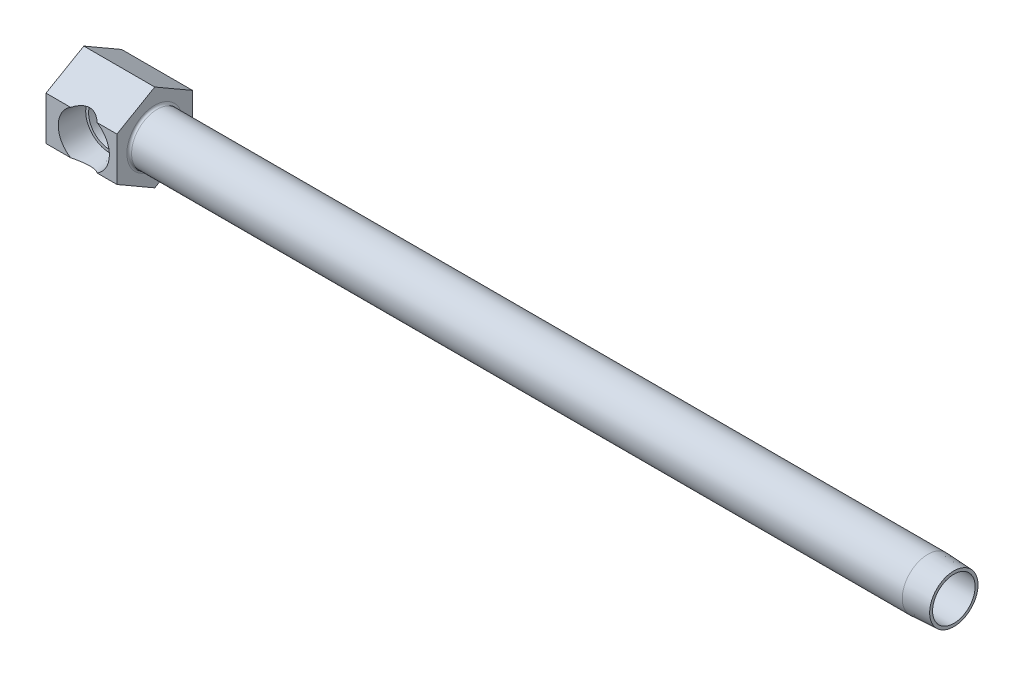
ISO-10303-21;
HEADER;
FILE_DESCRIPTION(('STEP AP214'),'2;1');
FILE_NAME('part.step','',(''),(''),'','','');
FILE_SCHEMA(('AUTOMOTIVE_DESIGN { 1 0 10303 214 1 1 1 1 }'));
ENDSEC;
DATA;
#1=APPLICATION_CONTEXT('core data for automotive mechanical design processes');
#2=APPLICATION_PROTOCOL_DEFINITION('international standard','automotive_design',2000,#1);
#3=PRODUCT_CONTEXT('',#1,'mechanical');
#4=PRODUCT('Part','Part','',(#3));
#5=PRODUCT_RELATED_PRODUCT_CATEGORY('part','',(#4));
#6=PRODUCT_DEFINITION_FORMATION('','',#4);
#7=PRODUCT_DEFINITION_CONTEXT('part definition',#1,'design');
#8=PRODUCT_DEFINITION('design','',#6,#7);
#9=PRODUCT_DEFINITION_SHAPE('','',#8);
#10=(LENGTH_UNIT() NAMED_UNIT(*) SI_UNIT(.MILLI.,.METRE.));
#11=(NAMED_UNIT(*) PLANE_ANGLE_UNIT() SI_UNIT($,.RADIAN.));
#12=(NAMED_UNIT(*) SI_UNIT($,.STERADIAN.) SOLID_ANGLE_UNIT());
#13=UNCERTAINTY_MEASURE_WITH_UNIT(LENGTH_MEASURE(1.E-05),#10,'distance_accuracy_value','');
#14=(GEOMETRIC_REPRESENTATION_CONTEXT(3) GLOBAL_UNCERTAINTY_ASSIGNED_CONTEXT((#13)) GLOBAL_UNIT_ASSIGNED_CONTEXT((#10,
#11,#12)) REPRESENTATION_CONTEXT('',''));
#15=CARTESIAN_POINT('',(0.,0.,0.));
#16=DIRECTION('',(0.,0.,1.));
#17=DIRECTION('',(1.,0.,0.));
#18=AXIS2_PLACEMENT_3D('',#15,#16,#17);
#19=CARTESIAN_POINT('',(63.5,0.,12.7));
#20=DIRECTION('',(-1.,0.,0.));
#21=DIRECTION('',(0.,-1.,0.));
#22=AXIS2_PLACEMENT_3D('',#19,#20,#21);
#23=CYLINDRICAL_SURFACE('',#22,8.5725);
#24=CARTESIAN_POINT('',(24.5999,0.,12.7));
#25=DIRECTION('',(-1.,0.,0.));
#26=DIRECTION('',(0.,-1.,0.));
#27=AXIS2_PLACEMENT_3D('',#24,#25,#26);
#28=CIRCLE('',#27,8.5725);
#29=CARTESIAN_POINT('',(24.5999,-8.57249999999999,12.7));
#30=VERTEX_POINT('',#29);
#31=EDGE_CURVE('E22',#30,#30,#28,.F.);
#32=ORIENTED_EDGE('',*,*,#31,.T.);
#33=EDGE_LOOP('',(#32));
#34=FACE_BOUND('',#33,.T.);
#35=CARTESIAN_POINT('',(283.3624,0.,12.7));
#36=DIRECTION('',(1.,0.,0.));
#37=DIRECTION('',(0.,0.,-1.));
#38=AXIS2_PLACEMENT_3D('',#35,#36,#37);
#39=CIRCLE('',#38,8.5725);
#40=CARTESIAN_POINT('',(283.3624,0.,4.1275));
#41=VERTEX_POINT('',#40);
#42=EDGE_CURVE('E153',#41,#41,#39,.T.);
#43=ORIENTED_EDGE('',*,*,#42,.F.);
#44=EDGE_LOOP('',(#43));
#45=FACE_BOUND('',#44,.T.);
#46=ADVANCED_FACE('F15',(#34,#45),#23,.T.);
#47=CARTESIAN_POINT('',(23.8125,14.6646968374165,12.7));
#48=DIRECTION('',(0.,-0.866025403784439,-0.5));
#49=DIRECTION('',(0.,0.5,-0.866025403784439));
#50=AXIS2_PLACEMENT_3D('',#47,#48,#49);
#51=PLANE('',#50);
#52=CARTESIAN_POINT('',(12.7,-0.84553451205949,39.56450873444));
#53=DIRECTION('',(0.,-0.866025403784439,-0.5));
#54=DIRECTION('',(0.,-0.5,0.866025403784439));
#55=AXIS2_PLACEMENT_3D('',#52,#53,#54);
#56=ELLIPSE('',#55,18.6296608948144,9.27637524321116);
#57=CARTESIAN_POINT('',(17.1412186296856,7.33234841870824,25.4));
#58=VERTEX_POINT('',#57);
#59=CARTESIAN_POINT('',(8.25878137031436,7.33234841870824,25.4));
#60=VERTEX_POINT('',#59);
#61=EDGE_CURVE('E232',#58,#60,#56,.F.);
#62=ORIENTED_EDGE('',*,*,#61,.F.);
#63=DIRECTION('',(-1.,0.,0.));
#64=VECTOR('',#63,1.);
#65=CARTESIAN_POINT('',(23.8125,7.33234841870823,25.4));
#66=LINE('',#65,#64);
#67=CARTESIAN_POINT('',(23.8125,7.33234841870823,25.4));
#68=VERTEX_POINT('',#67);
#69=EDGE_CURVE('E202',#68,#58,#66,.T.);
#70=ORIENTED_EDGE('',*,*,#69,.F.);
#71=DIRECTION('',(0.,-0.5,0.866025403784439));
#72=VECTOR('',#71,1.);
#73=CARTESIAN_POINT('',(23.8125,14.6646968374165,12.7));
#74=LINE('',#73,#72);
#75=CARTESIAN_POINT('',(23.8125,14.6646968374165,12.7));
#76=VERTEX_POINT('',#75);
#77=EDGE_CURVE('E222',#76,#68,#74,.T.);
#78=ORIENTED_EDGE('',*,*,#77,.F.);
#79=DIRECTION('',(-1.,0.,0.));
#80=VECTOR('',#79,1.);
#81=CARTESIAN_POINT('',(23.8125,14.6646968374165,12.7));
#82=LINE('',#81,#80);
#83=CARTESIAN_POINT('',(0.,14.6646968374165,12.7));
#84=VERTEX_POINT('',#83);
#85=EDGE_CURVE('E199',#76,#84,#82,.T.);
#86=ORIENTED_EDGE('',*,*,#85,.T.);
#87=DIRECTION('',(0.,-0.5,0.866025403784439));
#88=VECTOR('',#87,1.);
#89=CARTESIAN_POINT('',(0.,14.6646968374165,12.7));
#90=LINE('',#89,#88);
#91=CARTESIAN_POINT('',(0.,7.33234841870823,25.4));
#92=VERTEX_POINT('',#91);
#93=EDGE_CURVE('E239',#84,#92,#90,.T.);
#94=ORIENTED_EDGE('',*,*,#93,.T.);
#95=EDGE_CURVE('E205',#60,#92,#66,.T.);
#96=ORIENTED_EDGE('',*,*,#95,.F.);
#97=EDGE_LOOP('',(#62,#70,#78,#86,#94,#96));
#98=FACE_BOUND('',#97,.T.);
#99=ADVANCED_FACE('F173',(#98),#51,.F.);
#100=CARTESIAN_POINT('',(23.8125,7.33234841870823,25.4));
#101=DIRECTION('',(0.,0.,-1.));
#102=DIRECTION('',(-1.,0.,0.));
#103=AXIS2_PLACEMENT_3D('',#100,#101,#102);
#104=PLANE('',#103);
#105=CARTESIAN_POINT('',(12.7,0.,25.4));
#106=DIRECTION('',(0.,0.,-1.));
#107=DIRECTION('',(-1.,0.,0.));
#108=AXIS2_PLACEMENT_3D('',#105,#106,#107);
#109=CIRCLE('',#108,8.5725);
#110=CARTESIAN_POINT('',(17.1412186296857,-7.33234841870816,25.4));
#111=VERTEX_POINT('',#110);
#112=EDGE_CURVE('E249',#58,#111,#109,.T.);
#113=ORIENTED_EDGE('',*,*,#112,.T.);
#114=DIRECTION('',(-1.,0.,0.));
#115=VECTOR('',#114,1.);
#116=CARTESIAN_POINT('',(23.8125,-7.33234841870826,25.4));
#117=LINE('',#116,#115);
#118=CARTESIAN_POINT('',(23.8125,-7.33234841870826,25.4));
#119=VERTEX_POINT('',#118);
#120=EDGE_CURVE('E206',#119,#111,#117,.T.);
#121=ORIENTED_EDGE('',*,*,#120,.F.);
#122=DIRECTION('',(0.,-1.,0.));
#123=VECTOR('',#122,1.);
#124=CARTESIAN_POINT('',(23.8125,7.33234841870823,25.4));
#125=LINE('',#124,#123);
#126=EDGE_CURVE('E220',#68,#119,#125,.T.);
#127=ORIENTED_EDGE('',*,*,#126,.F.);
#128=ORIENTED_EDGE('',*,*,#69,.T.);
#129=EDGE_LOOP('',(#113,#121,#127,#128));
#130=FACE_BOUND('',#129,.T.);
#131=ADVANCED_FACE('F179',(#130),#104,.F.);
#132=CARTESIAN_POINT('',(8.25878137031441,-7.33234841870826,25.4));
#133=VERTEX_POINT('',#132);
#134=EDGE_CURVE('E36',#133,#60,#109,.T.);
#135=ORIENTED_EDGE('',*,*,#134,.T.);
#136=ORIENTED_EDGE('',*,*,#95,.T.);
#137=DIRECTION('',(0.,-1.,0.));
#138=VECTOR('',#137,1.);
#139=CARTESIAN_POINT('',(0.,7.33234841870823,25.4));
#140=LINE('',#139,#138);
#141=CARTESIAN_POINT('',(0.,-7.33234841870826,25.4));
#142=VERTEX_POINT('',#141);
#143=EDGE_CURVE('E235',#92,#142,#140,.T.);
#144=ORIENTED_EDGE('',*,*,#143,.T.);
#145=EDGE_CURVE('E209',#133,#142,#117,.T.);
#146=ORIENTED_EDGE('',*,*,#145,.F.);
#147=EDGE_LOOP('',(#135,#136,#144,#146));
#148=FACE_BOUND('',#147,.T.);
#149=ADVANCED_FACE('F285',(#148),#104,.F.);
#150=CARTESIAN_POINT('',(23.8125,-7.33234841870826,25.4));
#151=DIRECTION('',(0.,0.86602540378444,-0.5));
#152=DIRECTION('',(0.,0.5,0.86602540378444));
#153=AXIS2_PLACEMENT_3D('',#150,#151,#152);
#154=PLANE('',#153);
#155=CARTESIAN_POINT('',(12.7,0.845534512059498,39.5645087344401));
#156=DIRECTION('',(0.,0.86602540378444,-0.5));
#157=DIRECTION('',(0.,0.5,0.86602540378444));
#158=AXIS2_PLACEMENT_3D('',#155,#156,#157);
#159=ELLIPSE('',#158,18.6296608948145,9.27637524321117);
#160=EDGE_CURVE('E10',#133,#111,#159,.F.);
#161=ORIENTED_EDGE('',*,*,#160,.F.);
#162=ORIENTED_EDGE('',*,*,#145,.T.);
#163=DIRECTION('',(0.,-0.5,-0.86602540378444));
#164=VECTOR('',#163,1.);
#165=CARTESIAN_POINT('',(0.,-7.33234841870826,25.4));
#166=LINE('',#165,#164);
#167=CARTESIAN_POINT('',(0.,-14.6646968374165,12.7));
#168=VERTEX_POINT('',#167);
#169=EDGE_CURVE('E218',#142,#168,#166,.T.);
#170=ORIENTED_EDGE('',*,*,#169,.T.);
#171=DIRECTION('',(-1.,0.,0.));
#172=VECTOR('',#171,1.);
#173=CARTESIAN_POINT('',(23.8125,-14.6646968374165,12.7));
#174=LINE('',#173,#172);
#175=CARTESIAN_POINT('',(23.8125,-14.6646968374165,12.7));
#176=VERTEX_POINT('',#175);
#177=EDGE_CURVE('E210',#176,#168,#174,.T.);
#178=ORIENTED_EDGE('',*,*,#177,.F.);
#179=DIRECTION('',(0.,-0.5,-0.86602540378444));
#180=VECTOR('',#179,1.);
#181=CARTESIAN_POINT('',(23.8125,-7.33234841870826,25.4));
#182=LINE('',#181,#180);
#183=EDGE_CURVE('E213',#119,#176,#182,.T.);
#184=ORIENTED_EDGE('',*,*,#183,.F.);
#185=ORIENTED_EDGE('',*,*,#120,.T.);
#186=EDGE_LOOP('',(#161,#162,#170,#178,#184,#185));
#187=FACE_BOUND('',#186,.T.);
#188=ADVANCED_FACE('F281',(#187),#154,.F.);
#189=CARTESIAN_POINT('',(23.8125,-14.6646968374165,12.7));
#190=DIRECTION('',(0.,0.866025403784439,0.5));
#191=DIRECTION('',(0.,-0.5,0.866025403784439));
#192=AXIS2_PLACEMENT_3D('',#189,#190,#191);
#193=PLANE('',#192);
#194=DIRECTION('',(0.,0.5,-0.866025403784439));
#195=VECTOR('',#194,1.);
#196=CARTESIAN_POINT('',(0.,-14.6646968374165,12.7));
#197=LINE('',#196,#195);
#198=CARTESIAN_POINT('',(0.,-7.33234841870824,0.));
#199=VERTEX_POINT('',#198);
#200=EDGE_CURVE('E227',#168,#199,#197,.T.);
#201=ORIENTED_EDGE('',*,*,#200,.T.);
#202=DIRECTION('',(-1.,0.,0.));
#203=VECTOR('',#202,1.);
#204=CARTESIAN_POINT('',(23.8125,-7.33234841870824,0.));
#205=LINE('',#204,#203);
#206=CARTESIAN_POINT('',(23.8125,-7.33234841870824,0.));
#207=VERTEX_POINT('',#206);
#208=EDGE_CURVE('E191',#207,#199,#205,.T.);
#209=ORIENTED_EDGE('',*,*,#208,.F.);
#210=DIRECTION('',(0.,0.5,-0.866025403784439));
#211=VECTOR('',#210,1.);
#212=CARTESIAN_POINT('',(23.8125,-14.6646968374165,12.7));
#213=LINE('',#212,#211);
#214=EDGE_CURVE('E214',#176,#207,#213,.T.);
#215=ORIENTED_EDGE('',*,*,#214,.F.);
#216=ORIENTED_EDGE('',*,*,#177,.T.);
#217=EDGE_LOOP('',(#201,#209,#215,#216));
#218=FACE_BOUND('',#217,.T.);
#219=ADVANCED_FACE('F284',(#218),#193,.F.);
#220=CARTESIAN_POINT('',(23.8125,-7.33234841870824,0.));
#221=DIRECTION('',(0.,0.,1.));
#222=DIRECTION('',(0.,-1.,0.));
#223=AXIS2_PLACEMENT_3D('',#220,#221,#222);
#224=PLANE('',#223);
#225=DIRECTION('',(0.,1.,0.));
#226=VECTOR('',#225,1.);
#227=CARTESIAN_POINT('',(0.,-7.33234841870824,0.));
#228=LINE('',#227,#226);
#229=CARTESIAN_POINT('',(0.,7.33234841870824,0.));
#230=VERTEX_POINT('',#229);
#231=EDGE_CURVE('E231',#199,#230,#228,.T.);
#232=ORIENTED_EDGE('',*,*,#231,.T.);
#233=DIRECTION('',(-1.,0.,0.));
#234=VECTOR('',#233,1.);
#235=CARTESIAN_POINT('',(23.8125,7.33234841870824,0.));
#236=LINE('',#235,#234);
#237=CARTESIAN_POINT('',(23.8125,7.33234841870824,0.));
#238=VERTEX_POINT('',#237);
#239=EDGE_CURVE('E196',#238,#230,#236,.T.);
#240=ORIENTED_EDGE('',*,*,#239,.F.);
#241=DIRECTION('',(0.,1.,0.));
#242=VECTOR('',#241,1.);
#243=CARTESIAN_POINT('',(23.8125,-7.33234841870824,0.));
#244=LINE('',#243,#242);
#245=EDGE_CURVE('E217',#207,#238,#244,.T.);
#246=ORIENTED_EDGE('',*,*,#245,.F.);
#247=ORIENTED_EDGE('',*,*,#208,.T.);
#248=EDGE_LOOP('',(#232,#240,#246,#247));
#249=FACE_BOUND('',#248,.T.);
#250=ADVANCED_FACE('F292',(#249),#224,.F.);
#251=CARTESIAN_POINT('',(23.8125,7.33234841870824,0.));
#252=DIRECTION('',(0.,-0.866025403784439,0.5));
#253=DIRECTION('',(0.,-0.5,-0.866025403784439));
#254=AXIS2_PLACEMENT_3D('',#251,#252,#253);
#255=PLANE('',#254);
#256=DIRECTION('',(0.,0.5,0.866025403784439));
#257=VECTOR('',#256,1.);
#258=CARTESIAN_POINT('',(0.,7.33234841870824,0.));
#259=LINE('',#258,#257);
#260=EDGE_CURVE('E243',#230,#84,#259,.T.);
#261=ORIENTED_EDGE('',*,*,#260,.T.);
#262=ORIENTED_EDGE('',*,*,#85,.F.);
#263=DIRECTION('',(0.,0.5,0.866025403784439));
#264=VECTOR('',#263,1.);
#265=CARTESIAN_POINT('',(23.8125,7.33234841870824,0.));
#266=LINE('',#265,#264);
#267=EDGE_CURVE('E224',#238,#76,#266,.T.);
#268=ORIENTED_EDGE('',*,*,#267,.F.);
#269=ORIENTED_EDGE('',*,*,#239,.T.);
#270=EDGE_LOOP('',(#261,#262,#268,#269));
#271=FACE_BOUND('',#270,.T.);
#272=ADVANCED_FACE('F279',(#271),#255,.F.);
#273=CARTESIAN_POINT('',(23.8125,-21.9970452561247,25.4));
#274=DIRECTION('',(-1.,0.,0.));
#275=DIRECTION('',(0.,-1.,0.));
#276=AXIS2_PLACEMENT_3D('',#273,#274,#275);
#277=PLANE('',#276);
#278=CARTESIAN_POINT('',(23.8125,0.,12.7));
#279=DIRECTION('',(-1.,0.,0.));
#280=DIRECTION('',(0.,-1.,0.));
#281=AXIS2_PLACEMENT_3D('',#278,#279,#280);
#282=CIRCLE('',#281,9.3599);
#283=CARTESIAN_POINT('',(23.8125,-9.35989999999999,12.7));
#284=VERTEX_POINT('',#283);
#285=EDGE_CURVE('E189',#284,#284,#282,.T.);
#286=ORIENTED_EDGE('',*,*,#285,.T.);
#287=EDGE_LOOP('',(#286));
#288=FACE_BOUND('',#287,.T.);
#289=ORIENTED_EDGE('',*,*,#214,.T.);
#290=ORIENTED_EDGE('',*,*,#245,.T.);
#291=ORIENTED_EDGE('',*,*,#267,.T.);
#292=ORIENTED_EDGE('',*,*,#77,.T.);
#293=ORIENTED_EDGE('',*,*,#126,.T.);
#294=ORIENTED_EDGE('',*,*,#183,.T.);
#295=EDGE_LOOP('',(#289,#290,#291,#292,#293,#294));
#296=FACE_BOUND('',#295,.T.);
#297=ADVANCED_FACE('F275',(#288,#296),#277,.F.);
#298=CARTESIAN_POINT('',(0.,-21.9970452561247,25.4));
#299=DIRECTION('',(-1.,0.,0.));
#300=DIRECTION('',(0.,-1.,0.));
#301=AXIS2_PLACEMENT_3D('',#298,#299,#300);
#302=PLANE('',#301);
#303=ORIENTED_EDGE('',*,*,#200,.F.);
#304=ORIENTED_EDGE('',*,*,#169,.F.);
#305=ORIENTED_EDGE('',*,*,#143,.F.);
#306=ORIENTED_EDGE('',*,*,#93,.F.);
#307=ORIENTED_EDGE('',*,*,#260,.F.);
#308=ORIENTED_EDGE('',*,*,#231,.F.);
#309=EDGE_LOOP('',(#303,#304,#305,#306,#307,#308));
#310=FACE_BOUND('',#309,.T.);
#311=ADVANCED_FACE('F272',(#310),#302,.T.);
#312=CARTESIAN_POINT('',(24.5999,0.,12.7));
#313=DIRECTION('',(-1.,0.,0.));
#314=DIRECTION('',(0.,-1.,0.));
#315=AXIS2_PLACEMENT_3D('',#312,#313,#314);
#316=TOROIDAL_SURFACE('',#315,9.3599,0.7874);
#317=ORIENTED_EDGE('',*,*,#31,.F.);
#318=EDGE_LOOP('',(#317));
#319=FACE_BOUND('',#318,.T.);
#320=ORIENTED_EDGE('',*,*,#285,.F.);
#321=EDGE_LOOP('',(#320));
#322=FACE_BOUND('',#321,.T.);
#323=ADVANCED_FACE('F269',(#319,#322),#316,.F.);
#324=CARTESIAN_POINT('',(12.7,0.,25.4));
#325=DIRECTION('',(0.,0.,1.));
#326=DIRECTION('',(1.,0.,0.));
#327=AXIS2_PLACEMENT_3D('',#324,#325,#326);
#328=CONICAL_SURFACE('',#327,8.5725,0.0523598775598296);
#329=CARTESIAN_POINT('',(18.2237788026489,-5.94425228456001,16.6622));
#330=CARTESIAN_POINT('',(18.2916176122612,-5.88732299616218,16.7476009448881));
#331=CARTESIAN_POINT('',(18.3592795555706,-5.82850059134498,16.8318676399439));
#332=CARTESIAN_POINT('',(18.4939968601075,-5.70702027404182,16.9981035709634));
#333=CARTESIAN_POINT('',(18.5610521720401,-5.64436205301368,17.0800726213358));
#334=CARTESIAN_POINT('',(18.761107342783,-5.45038497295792,17.3227058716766));
#335=CARTESIAN_POINT('',(18.8927964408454,-5.31322998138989,17.479846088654));
#336=CARTESIAN_POINT('',(19.1518580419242,-5.0216447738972,17.785397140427));
#337=CARTESIAN_POINT('',(19.2791735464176,-4.8670541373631,17.933703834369));
#338=CARTESIAN_POINT('',(19.5257752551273,-4.5416930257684,18.2184184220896));
#339=CARTESIAN_POINT('',(19.6450670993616,-4.37093412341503,18.35483469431));
#340=CARTESIAN_POINT('',(19.9295445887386,-3.92497659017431,18.6779693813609));
#341=CARTESIAN_POINT('',(20.0885588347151,-3.63961711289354,18.8565618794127));
#342=CARTESIAN_POINT('',(20.3031266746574,-3.18637161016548,19.0960411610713));
#343=CARTESIAN_POINT('',(20.3705741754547,-3.03133869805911,19.1710418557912));
#344=CARTESIAN_POINT('',(20.4965477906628,-2.71316594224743,19.3107517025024));
#345=CARTESIAN_POINT('',(20.5550753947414,-2.55002745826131,19.3754625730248));
#346=CARTESIAN_POINT('',(20.6538405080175,-2.24208944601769,19.4844409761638));
#347=CARTESIAN_POINT('',(20.6955064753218,-2.09831594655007,19.5303217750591));
#348=CARTESIAN_POINT('',(20.7709604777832,-1.80624508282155,19.6132970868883));
#349=CARTESIAN_POINT('',(20.8047499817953,-1.65794856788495,19.6503932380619));
#350=CARTESIAN_POINT('',(20.8638747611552,-1.35762804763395,19.7152415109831));
#351=CARTESIAN_POINT('',(20.8892082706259,-1.20560327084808,19.7429916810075));
#352=CARTESIAN_POINT('',(20.9309344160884,-0.898862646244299,19.7886706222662));
#353=CARTESIAN_POINT('',(20.9473269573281,-0.744146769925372,19.8065992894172));
#354=CARTESIAN_POINT('',(20.9708773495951,-0.43270553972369,19.8323499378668));
#355=CARTESIAN_POINT('',(20.9780075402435,-0.275975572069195,19.8401416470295));
#356=CARTESIAN_POINT('',(20.9827943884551,0.0378027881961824,19.8453730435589));
#357=CARTESIAN_POINT('',(20.9804510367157,0.194851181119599,19.8428127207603));
#358=CARTESIAN_POINT('',(20.9663398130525,0.508011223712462,19.8273884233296));
#359=CARTESIAN_POINT('',(20.9545719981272,0.664122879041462,19.8145245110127));
#360=CARTESIAN_POINT('',(20.9218545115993,0.974205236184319,19.77873224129));
#361=CARTESIAN_POINT('',(20.9009049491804,1.12817596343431,19.755804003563));
#362=CARTESIAN_POINT('',(20.8514678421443,1.42545941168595,19.701637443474));
#363=CARTESIAN_POINT('',(20.8233975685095,1.56892578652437,19.670858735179));
#364=CARTESIAN_POINT('',(20.7597875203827,1.85215468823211,19.6010144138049));
#365=CARTESIAN_POINT('',(20.7242449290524,1.99191579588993,19.5619456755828));
#366=CARTESIAN_POINT('',(20.6072066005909,2.40450989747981,19.4330773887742));
#367=CARTESIAN_POINT('',(20.5152596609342,2.67089071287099,19.3315714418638));
#368=CARTESIAN_POINT('',(20.3408066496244,3.10208873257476,19.1379689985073));
#369=CARTESIAN_POINT('',(20.2643220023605,3.27264094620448,19.0528363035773));
#370=CARTESIAN_POINT('',(20.1020422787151,3.60309741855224,18.8714152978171));
#371=CARTESIAN_POINT('',(20.0162439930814,3.76299797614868,18.7751231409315));
#372=CARTESIAN_POINT('',(19.7465644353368,4.22699236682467,18.4708514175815));
#373=CARTESIAN_POINT('',(19.550728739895,4.51459085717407,18.2478400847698));
#374=CARTESIAN_POINT('',(19.2565333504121,4.89305951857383,17.9071622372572));
#375=CARTESIAN_POINT('',(19.1663785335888,5.00247887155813,17.8020703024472));
#376=CARTESIAN_POINT('',(18.9830153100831,5.21324568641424,17.5865045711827));
#377=CARTESIAN_POINT('',(18.8898069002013,5.31459313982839,17.4760307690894));
#378=CARTESIAN_POINT('',(18.7018932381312,5.50848003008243,17.2510129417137));
#379=CARTESIAN_POINT('',(18.6072061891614,5.60108407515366,17.1365090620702));
#380=CARTESIAN_POINT('',(18.4163909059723,5.77848578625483,16.9028222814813));
#381=CARTESIAN_POINT('',(18.320263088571,5.86328566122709,16.783640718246));
#382=CARTESIAN_POINT('',(18.2237788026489,5.94425228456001,16.6622));
#383=B_SPLINE_CURVE_WITH_KNOTS('',3,(#329,#330,#331,#332,#333,#334,#335,#336,#337,#338,#339,
#340,#341,#342,#343,#344,#345,#346,#347,#348,#349,#350,#351,#352,#353,#354,#355,#356,#357,#358,
#359,#360,#361,#362,#363,#364,#365,#366,#367,#368,#369,#370,#371,#372,#373,#374,#375,#376,#377,
#378,#379,#380,#381,#382),.UNSPECIFIED.,.F.,.F.,(4,2,2,2,2,2,2,2,2,2,2,2,2,2,2,2,2,2,2,2,2,2,2,
2,2,2,4),(0.,0.369050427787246,0.738130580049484,1.47737063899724,2.22407355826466,
2.97024599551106,4.0822255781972,4.63656388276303,5.19080950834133,5.66002823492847,
6.12915938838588,6.59838844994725,7.0676224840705,7.53825460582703,8.00888718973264,
8.47951692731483,8.95014106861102,9.3978219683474,9.8456719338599,10.7406458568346,
11.3560801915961,11.9717272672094,13.2057730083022,13.7350494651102,14.2643264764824,
14.7893227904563,15.3141700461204),.UNSPECIFIED.);
#384=CARTESIAN_POINT('',(18.2239376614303,-5.94411896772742,16.6624));
#385=VERTEX_POINT('',#384);
#386=CARTESIAN_POINT('',(18.2239376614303,5.94411896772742,16.6624));
#387=VERTEX_POINT('',#386);
#388=EDGE_CURVE('E128',#385,#387,#383,.T.);
#389=ORIENTED_EDGE('',*,*,#388,.F.);
#390=CARTESIAN_POINT('',(12.7,0.,16.6624));
#391=DIRECTION('',(0.,0.,-1.));
#392=DIRECTION('',(-1.,0.,0.));
#393=AXIS2_PLACEMENT_3D('',#390,#391,#392);
#394=CIRCLE('',#393,8.1145817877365);
#395=EDGE_CURVE('E251',#385,#387,#394,.T.);
#396=ORIENTED_EDGE('',*,*,#395,.T.);
#397=EDGE_LOOP('',(#389,#396));
#398=FACE_BOUND('',#397,.T.);
#399=ORIENTED_EDGE('',*,*,#61,.T.);
#400=ORIENTED_EDGE('',*,*,#134,.F.);
#401=ORIENTED_EDGE('',*,*,#160,.T.);
#402=ORIENTED_EDGE('',*,*,#112,.F.);
#403=EDGE_LOOP('',(#399,#400,#401,#402));
#404=FACE_BOUND('',#403,.T.);
#405=ADVANCED_FACE('F136',(#398,#404),#328,.F.);
#406=CARTESIAN_POINT('',(20.8145817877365,0.,16.6624));
#407=DIRECTION('',(0.,0.,1.));
#408=DIRECTION('',(1.,0.,0.));
#409=AXIS2_PLACEMENT_3D('',#406,#407,#408);
#410=PLANE('',#409);
#411=DIRECTION('',(1.,0.,0.));
#412=VECTOR('',#411,1.);
#413=CARTESIAN_POINT('',(66.667520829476,-5.94411896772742,16.6624));
#414=LINE('',#413,#412);
#415=CARTESIAN_POINT('',(16.6624,-5.9441189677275,16.6624));
#416=VERTEX_POINT('',#415);
#417=EDGE_CURVE('E123',#416,#385,#414,.T.);
#418=ORIENTED_EDGE('',*,*,#417,.F.);
#419=CARTESIAN_POINT('',(12.7,0.,16.6624));
#420=DIRECTION('',(0.,0.,-1.));
#421=DIRECTION('',(-1.,0.,0.));
#422=AXIS2_PLACEMENT_3D('',#419,#420,#421);
#423=CIRCLE('',#422,7.14375);
#424=CARTESIAN_POINT('',(16.6624,5.9441189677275,16.6624));
#425=VERTEX_POINT('',#424);
#426=EDGE_CURVE('E119',#416,#425,#423,.T.);
#427=ORIENTED_EDGE('',*,*,#426,.T.);
#428=DIRECTION('',(1.,0.,0.));
#429=VECTOR('',#428,1.);
#430=CARTESIAN_POINT('',(66.667520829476,5.94411896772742,16.6624));
#431=LINE('',#430,#429);
#432=EDGE_CURVE('E120',#387,#425,#431,.F.);
#433=ORIENTED_EDGE('',*,*,#432,.F.);
#434=ORIENTED_EDGE('',*,*,#395,.F.);
#435=EDGE_LOOP('',(#418,#427,#433,#434));
#436=FACE_BOUND('',#435,.T.);
#437=ADVANCED_FACE('F262',(#436),#410,.T.);
#438=CARTESIAN_POINT('',(12.7,0.,34.595573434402));
#439=DIRECTION('',(0.,0.,-1.));
#440=DIRECTION('',(-1.,0.,0.));
#441=AXIS2_PLACEMENT_3D('',#438,#439,#440);
#442=CYLINDRICAL_SURFACE('',#441,7.14375);
#443=CARTESIAN_POINT('',(12.7,0.,12.7));
#444=DIRECTION('',(0.707106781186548,0.,-0.707106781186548));
#445=DIRECTION('',(-0.707106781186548,0.,-0.707106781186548));
#446=AXIS2_PLACEMENT_3D('',#443,#444,#445);
#447=ELLIPSE('',#446,10.1027881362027,7.14375);
#448=CARTESIAN_POINT('',(12.7,7.14375,12.7));
#449=VERTEX_POINT('',#448);
#450=EDGE_CURVE('E121',#425,#449,#447,.F.);
#451=ORIENTED_EDGE('',*,*,#450,.F.);
#452=ORIENTED_EDGE('',*,*,#426,.F.);
#453=CARTESIAN_POINT('',(12.7,-7.14375,12.7));
#454=VERTEX_POINT('',#453);
#455=EDGE_CURVE('E108',#454,#416,#447,.F.);
#456=ORIENTED_EDGE('',*,*,#455,.F.);
#457=CARTESIAN_POINT('',(12.7,0.,12.7));
#458=DIRECTION('',(-0.707106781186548,0.,-0.707106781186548));
#459=DIRECTION('',(0.707106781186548,0.,-0.707106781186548));
#460=AXIS2_PLACEMENT_3D('',#457,#458,#459);
#461=ELLIPSE('',#460,10.1027881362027,7.14375);
#462=CARTESIAN_POINT('',(18.1005540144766,-4.67623570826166,7.2994459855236));
#463=VERTEX_POINT('',#462);
#464=EDGE_CURVE('E104',#463,#454,#461,.T.);
#465=ORIENTED_EDGE('',*,*,#464,.F.);
#466=CARTESIAN_POINT('',(12.7,0.,7.2994459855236));
#467=DIRECTION('',(0.,0.,-1.));
#468=DIRECTION('',(-1.,0.,0.));
#469=AXIS2_PLACEMENT_3D('',#466,#467,#468);
#470=CIRCLE('',#469,7.14375);
#471=CARTESIAN_POINT('',(18.1005540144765,4.67623570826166,7.2994459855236));
#472=VERTEX_POINT('',#471);
#473=EDGE_CURVE('E134',#463,#472,#470,.T.);
#474=ORIENTED_EDGE('',*,*,#473,.T.);
#475=EDGE_CURVE('E29',#449,#472,#461,.T.);
#476=ORIENTED_EDGE('',*,*,#475,.F.);
#477=EDGE_LOOP('',(#451,#452,#456,#465,#474,#476));
#478=FACE_BOUND('',#477,.T.);
#479=ADVANCED_FACE('F117',(#478),#442,.F.);
#480=CARTESIAN_POINT('',(12.7,0.,7.2994459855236));
#481=DIRECTION('',(0.,0.,1.));
#482=DIRECTION('',(1.,0.,0.));
#483=AXIS2_PLACEMENT_3D('',#480,#481,#482);
#484=CONICAL_SURFACE('',#483,7.14375,1.0471975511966);
#485=CARTESIAN_POINT('',(18.1008122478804,4.67646667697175,7.29964598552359));
#486=CARTESIAN_POINT('',(18.0182484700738,4.60263120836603,7.23572166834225));
#487=CARTESIAN_POINT('',(17.9383238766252,4.52571856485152,7.17175555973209));
#488=CARTESIAN_POINT('',(17.7848563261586,4.36518020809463,7.0441228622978));
#489=CARTESIAN_POINT('',(17.7113260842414,4.28154172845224,6.98045709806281));
#490=CARTESIAN_POINT('',(17.5726476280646,4.1079855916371,6.8545747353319));
#491=CARTESIAN_POINT('',(17.5074361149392,4.01812452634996,6.79235056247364));
#492=CARTESIAN_POINT('',(17.3859720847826,3.83151153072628,6.66964834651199));
#493=CARTESIAN_POINT('',(17.3297132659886,3.73476451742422,6.60916909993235));
#494=CARTESIAN_POINT('',(17.2264163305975,3.53345239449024,6.49019348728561));
#495=CARTESIAN_POINT('',(17.1794940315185,3.42880893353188,6.43172867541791));
#496=CARTESIAN_POINT('',(17.0960237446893,3.21346156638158,6.31865082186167));
#497=CARTESIAN_POINT('',(17.0594774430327,3.10275667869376,6.26403840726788));
#498=CARTESIAN_POINT('',(16.996254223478,2.87633249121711,6.15970832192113));
#499=CARTESIAN_POINT('',(16.9695794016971,2.76061213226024,6.10999169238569));
#500=CARTESIAN_POINT('',(16.9248366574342,2.52527852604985,6.01627423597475));
#501=CARTESIAN_POINT('',(16.9067703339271,2.40566455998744,5.97227447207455));
#502=CARTESIAN_POINT('',(16.872150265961,2.11917129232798,5.87557836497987));
#503=CARTESIAN_POINT('',(16.8585719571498,1.95102064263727,5.82559588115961));
#504=CARTESIAN_POINT('',(16.8395248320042,1.61106163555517,5.73806695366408));
#505=CARTESIAN_POINT('',(16.834060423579,1.43925134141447,5.70052727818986));
#506=CARTESIAN_POINT('',(16.8272216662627,1.09272483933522,5.63811598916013));
#507=CARTESIAN_POINT('',(16.8258602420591,0.918001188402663,5.61328461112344));
#508=CARTESIAN_POINT('',(16.8244844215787,0.567245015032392,5.576623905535));
#509=CARTESIAN_POINT('',(16.8244696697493,0.391212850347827,5.56479114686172));
#510=CARTESIAN_POINT('',(16.8244315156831,0.0298631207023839,5.55391234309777));
#511=CARTESIAN_POINT('',(16.8244077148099,-0.155475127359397,5.55554105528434));
#512=CARTESIAN_POINT('',(16.8245481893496,-0.525517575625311,5.57319743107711));
#513=CARTESIAN_POINT('',(16.8247125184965,-0.710221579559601,5.58922920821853));
#514=CARTESIAN_POINT('',(16.8272365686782,-1.07761401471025,5.63557061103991));
#515=CARTESIAN_POINT('',(16.8295939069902,-1.26030441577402,5.66586472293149));
#516=CARTESIAN_POINT('',(16.8402108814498,-1.62260116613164,5.74051131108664));
#517=CARTESIAN_POINT('',(16.8484676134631,-1.80220898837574,5.78485686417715));
#518=CARTESIAN_POINT('',(16.8713785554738,-2.09762253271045,5.87004472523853));
#519=CARTESIAN_POINT('',(16.8829850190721,-2.21474934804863,5.90713222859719));
#520=CARTESIAN_POINT('',(16.9127302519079,-2.44618190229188,5.98700326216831));
#521=CARTESIAN_POINT('',(16.9308663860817,-2.56048875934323,6.02978449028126));
#522=CARTESIAN_POINT('',(16.9750927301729,-2.78506409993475,6.12039584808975));
#523=CARTESIAN_POINT('',(17.0011553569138,-2.89534512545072,6.16820809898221));
#524=CARTESIAN_POINT('',(17.0623258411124,-3.11130073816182,6.26827147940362));
#525=CARTESIAN_POINT('',(17.0974329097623,-3.21697572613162,6.3205222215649));
#526=CARTESIAN_POINT('',(17.1773511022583,-3.42340093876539,6.42886299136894));
#527=CARTESIAN_POINT('',(17.2222166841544,-3.52411947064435,6.48497330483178));
#528=CARTESIAN_POINT('',(17.3212699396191,-3.71931545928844,6.59977977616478));
#529=CARTESIAN_POINT('',(17.3754591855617,-3.81379185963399,6.65847636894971));
#530=CARTESIAN_POINT('',(17.4924791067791,-3.99641031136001,6.77768652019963));
#531=CARTESIAN_POINT('',(17.5553313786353,-4.08453566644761,6.83820431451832));
#532=CARTESIAN_POINT('',(17.6884734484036,-4.25426378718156,6.96019752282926));
#533=CARTESIAN_POINT('',(17.758764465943,-4.3358654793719,7.02167309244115));
#534=CARTESIAN_POINT('',(17.8750599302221,-4.46018946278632,7.11938400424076));
#535=CARTESIAN_POINT('',(17.9190095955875,-4.5049692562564,7.15548532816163));
#536=CARTESIAN_POINT('',(18.0086324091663,-4.59230195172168,7.22760435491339));
#537=CARTESIAN_POINT('',(18.0542970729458,-4.6348638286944,7.26362172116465));
#538=CARTESIAN_POINT('',(18.1008122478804,-4.67646667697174,7.29964598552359));
#539=B_SPLINE_CURVE_WITH_KNOTS('',3,(#485,#486,#487,#488,#489,#490,#491,#492,#493,#494,#495,
#496,#497,#498,#499,#500,#501,#502,#503,#504,#505,#506,#507,#508,#509,#510,#511,#512,#513,#514,
#515,#516,#517,#518,#519,#520,#521,#522,#523,#524,#525,#526,#527,#528,#529,#530,#531,#532,#533,
#534,#535,#536,#537,#538),.UNSPECIFIED.,.F.,.F.,(4,2,2,2,2,2,2,2,2,2,2,2,2,2,2,2,2,2,2,2,2,2,2,
2,2,2,4),(0.,0.383734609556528,0.768215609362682,1.14957007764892,1.530654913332,
1.91620690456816,2.30182151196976,2.68751795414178,3.07328600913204,3.60029069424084,
4.12758157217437,4.65653172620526,5.18534222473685,5.74081422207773,6.29644491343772,
6.8514726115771,7.40622727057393,7.77616444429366,8.14595249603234,8.5144681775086,
8.8829517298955,9.25354694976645,9.62420472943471,9.99580384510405,10.3674639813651,
10.5845818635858,10.8007392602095),.UNSPECIFIED.);
#540=EDGE_CURVE('E110',#472,#463,#539,.T.);
#541=ORIENTED_EDGE('',*,*,#540,.F.);
#542=ORIENTED_EDGE('',*,*,#473,.F.);
#543=EDGE_LOOP('',(#541,#542));
#544=FACE_BOUND('',#543,.T.);
#545=CARTESIAN_POINT('',(12.7,0.,3.1750000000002));
#546=VERTEX_POINT('',#545);
#547=VERTEX_LOOP('',#546);
#548=FACE_BOUND('',#547,.T.);
#549=ADVANCED_FACE('F144',(#544,#548),#484,.F.);
#550=CARTESIAN_POINT('',(66.667520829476,0.,12.7));
#551=DIRECTION('',(1.,0.,0.));
#552=DIRECTION('',(0.,0.,-1.));
#553=AXIS2_PLACEMENT_3D('',#550,#551,#552);
#554=CYLINDRICAL_SURFACE('',#553,7.1437499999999);
#555=ORIENTED_EDGE('',*,*,#388,.T.);
#556=ORIENTED_EDGE('',*,*,#432,.T.);
#557=ORIENTED_EDGE('',*,*,#450,.T.);
#558=ORIENTED_EDGE('',*,*,#475,.T.);
#559=ORIENTED_EDGE('',*,*,#540,.T.);
#560=ORIENTED_EDGE('',*,*,#464,.T.);
#561=ORIENTED_EDGE('',*,*,#455,.T.);
#562=ORIENTED_EDGE('',*,*,#417,.T.);
#563=EDGE_LOOP('',(#555,#556,#557,#558,#559,#560,#561,#562));
#564=FACE_BOUND('',#563,.T.);
#565=CARTESIAN_POINT('',(292.1,0.,12.7));
#566=DIRECTION('',(1.,0.,0.));
#567=DIRECTION('',(0.,0.,-1.));
#568=AXIS2_PLACEMENT_3D('',#565,#566,#567);
#569=CIRCLE('',#568,7.1437499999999);
#570=CARTESIAN_POINT('',(292.1,0.,5.5562500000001));
#571=VERTEX_POINT('',#570);
#572=EDGE_CURVE('E159',#571,#571,#569,.T.);
#573=ORIENTED_EDGE('',*,*,#572,.T.);
#574=EDGE_LOOP('',(#573));
#575=FACE_BOUND('',#574,.T.);
#576=ADVANCED_FACE('F106',(#564,#575),#554,.F.);
#577=CARTESIAN_POINT('',(292.1,0.,12.7));
#578=DIRECTION('',(-1.,0.,0.));
#579=DIRECTION('',(0.,0.,1.));
#580=AXIS2_PLACEMENT_3D('',#577,#578,#579);
#581=CONICAL_SURFACE('',#580,8.11458178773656,0.052359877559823);
#582=ORIENTED_EDGE('',*,*,#42,.T.);
#583=EDGE_LOOP('',(#582));
#584=FACE_BOUND('',#583,.T.);
#585=CARTESIAN_POINT('',(292.1,0.,12.7));
#586=DIRECTION('',(1.,0.,0.));
#587=DIRECTION('',(0.,0.,-1.));
#588=AXIS2_PLACEMENT_3D('',#585,#586,#587);
#589=CIRCLE('',#588,8.11458178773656);
#590=CARTESIAN_POINT('',(292.1,0.,4.58541821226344));
#591=VERTEX_POINT('',#590);
#592=EDGE_CURVE('E156',#591,#591,#589,.T.);
#593=ORIENTED_EDGE('',*,*,#592,.F.);
#594=EDGE_LOOP('',(#593));
#595=FACE_BOUND('',#594,.T.);
#596=ADVANCED_FACE('F143',(#584,#595),#581,.T.);
#597=CARTESIAN_POINT('',(292.1,0.,5.5562500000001));
#598=DIRECTION('',(1.,0.,0.));
#599=DIRECTION('',(0.,0.,-1.));
#600=AXIS2_PLACEMENT_3D('',#597,#598,#599);
#601=PLANE('',#600);
#602=ORIENTED_EDGE('',*,*,#592,.T.);
#603=EDGE_LOOP('',(#602));
#604=FACE_BOUND('',#603,.T.);
#605=ORIENTED_EDGE('',*,*,#572,.F.);
#606=EDGE_LOOP('',(#605));
#607=FACE_BOUND('',#606,.T.);
#608=ADVANCED_FACE('F163',(#604,#607),#601,.T.);
#609=CLOSED_SHELL('',(#46,#99,#131,#149,#188,#219,#250,#272,#297,#311,#323,#405,#437,#479,#549,
#576,#596,#608));
#610=MANIFOLD_SOLID_BREP('B1',#609);
#611=ADVANCED_BREP_SHAPE_REPRESENTATION('',(#18,#610),#14);
#612=SHAPE_DEFINITION_REPRESENTATION(#9,#611);
ENDSEC;
END-ISO-10303-21;
